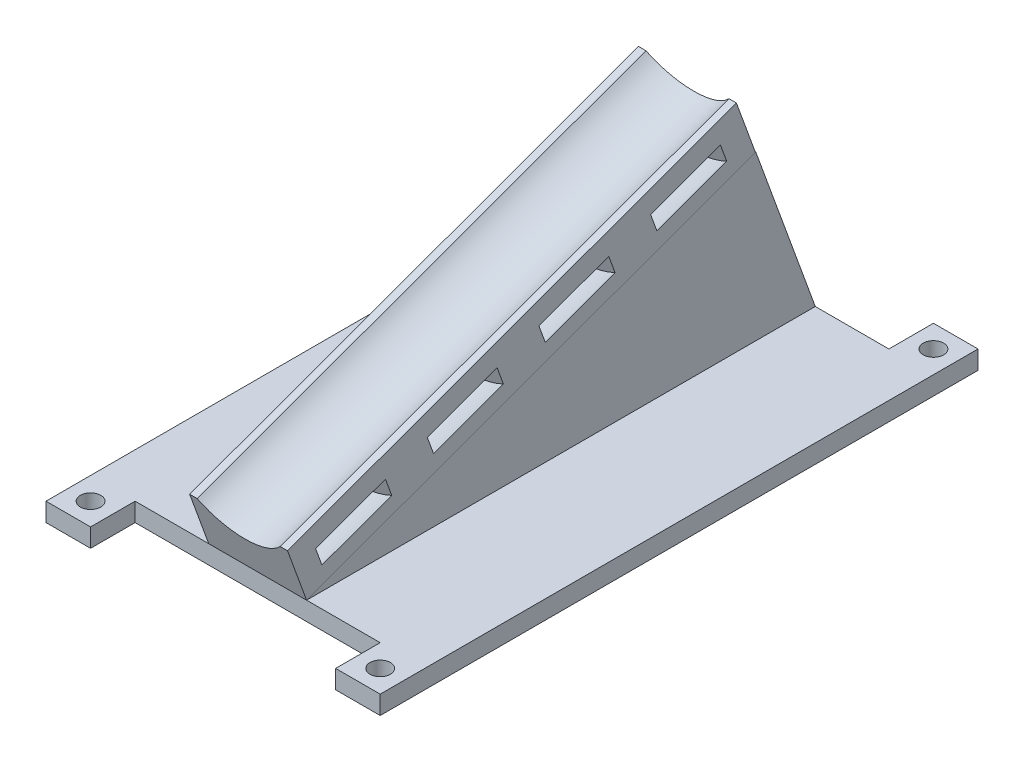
ISO-10303-21;
HEADER;
FILE_DESCRIPTION(('STEP AP214'),'2;1');
FILE_NAME('part.step','',(''),(''),'','','');
FILE_SCHEMA(('AUTOMOTIVE_DESIGN { 1 0 10303 214 1 1 1 1 }'));
ENDSEC;
DATA;
#1=APPLICATION_CONTEXT('core data for automotive mechanical design processes');
#2=APPLICATION_PROTOCOL_DEFINITION('international standard','automotive_design',2000,#1);
#3=PRODUCT_CONTEXT('',#1,'mechanical');
#4=PRODUCT('Part','Part','',(#3));
#5=PRODUCT_RELATED_PRODUCT_CATEGORY('part','',(#4));
#6=PRODUCT_DEFINITION_FORMATION('','',#4);
#7=PRODUCT_DEFINITION_CONTEXT('part definition',#1,'design');
#8=PRODUCT_DEFINITION('design','',#6,#7);
#9=PRODUCT_DEFINITION_SHAPE('','',#8);
#10=(LENGTH_UNIT() NAMED_UNIT(*) SI_UNIT(.MILLI.,.METRE.));
#11=(NAMED_UNIT(*) PLANE_ANGLE_UNIT() SI_UNIT($,.RADIAN.));
#12=(NAMED_UNIT(*) SI_UNIT($,.STERADIAN.) SOLID_ANGLE_UNIT());
#13=UNCERTAINTY_MEASURE_WITH_UNIT(LENGTH_MEASURE(1.E-05),#10,'distance_accuracy_value','');
#14=(GEOMETRIC_REPRESENTATION_CONTEXT(3) GLOBAL_UNCERTAINTY_ASSIGNED_CONTEXT((#13)) GLOBAL_UNIT_ASSIGNED_CONTEXT((#10,
#11,#12)) REPRESENTATION_CONTEXT('',''));
#15=CARTESIAN_POINT('',(0.,0.,0.));
#16=DIRECTION('',(0.,0.,1.));
#17=DIRECTION('',(1.,0.,0.));
#18=AXIS2_PLACEMENT_3D('',#15,#16,#17);
#19=CARTESIAN_POINT('',(58.1803398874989,48.9974712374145,-132.882058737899));
#20=DIRECTION('',(1.,0.,0.));
#21=DIRECTION('',(0.,0.,-1.));
#22=AXIS2_PLACEMENT_3D('',#19,#20,#21);
#23=PLANE('',#22);
#24=DIRECTION('',(0.,0.939692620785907,0.342020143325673));
#25=VECTOR('',#24,1.);
#26=CARTESIAN_POINT('',(58.1803398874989,5.,-12.));
#27=LINE('',#26,#25);
#28=CARTESIAN_POINT('',(58.1803398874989,5.,-12.));
#29=VERTEX_POINT('',#28);
#30=CARTESIAN_POINT('',(58.1803398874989,19.0953893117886,-6.86969785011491));
#31=VERTEX_POINT('',#30);
#32=EDGE_CURVE('E290',#29,#31,#27,.T.);
#33=ORIENTED_EDGE('',*,*,#32,.F.);
#34=DIRECTION('',(0.,-0.342020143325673,0.939692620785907));
#35=VECTOR('',#34,1.);
#36=CARTESIAN_POINT('',(58.1803398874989,48.9974712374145,-132.882058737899));
#37=LINE('',#36,#35);
#38=CARTESIAN_POINT('',(58.1803398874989,48.9974712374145,-132.882058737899));
#39=VERTEX_POINT('',#38);
#40=EDGE_CURVE('E327',#39,#29,#37,.T.);
#41=ORIENTED_EDGE('',*,*,#40,.F.);
#42=DIRECTION('',(0.,0.939692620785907,0.342020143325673));
#43=VECTOR('',#42,1.);
#44=CARTESIAN_POINT('',(58.1803398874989,48.9974712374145,-132.882058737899));
#45=LINE('',#44,#43);
#46=CARTESIAN_POINT('',(58.1803398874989,63.0928605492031,-127.751756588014));
#47=VERTEX_POINT('',#46);
#48=EDGE_CURVE('E291',#39,#47,#45,.T.);
#49=ORIENTED_EDGE('',*,*,#48,.T.);
#50=DIRECTION('',(0.,-0.342020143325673,0.939692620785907));
#51=VECTOR('',#50,1.);
#52=CARTESIAN_POINT('',(58.1803398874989,63.0928605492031,-127.751756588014));
#53=LINE('',#52,#51);
#54=EDGE_CURVE('E310',#47,#31,#53,.T.);
#55=ORIENTED_EDGE('',*,*,#54,.T.);
#56=EDGE_LOOP('',(#33,#41,#49,#55));
#57=FACE_BOUND('',#56,.T.);
#58=DIRECTION('',(0.,0.342020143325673,-0.939692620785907));
#59=VECTOR('',#58,1.);
#60=CARTESIAN_POINT('',(58.1803398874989,47.9359928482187,-117.254635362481));
#61=LINE('',#60,#59);
#62=CARTESIAN_POINT('',(58.1803398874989,17.9706339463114,-34.925488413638));
#63=VERTEX_POINT('',#62);
#64=CARTESIAN_POINT('',(58.1803398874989,11.130231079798,-16.1316359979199));
#65=VERTEX_POINT('',#64);
#66=EDGE_CURVE('E284',#63,#65,#61,.F.);
#67=ORIENTED_EDGE('',*,*,#66,.T.);
#68=DIRECTION('',(0.,0.939692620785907,0.342020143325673));
#69=VECTOR('',#68,1.);
#70=CARTESIAN_POINT('',(58.1803398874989,7.04498302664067,-17.6185446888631));
#71=LINE('',#70,#69);
#72=CARTESIAN_POINT('',(58.1803398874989,15.7829680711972,-14.4381782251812));
#73=VERTEX_POINT('',#72);
#74=EDGE_CURVE('E287',#65,#73,#71,.T.);
#75=ORIENTED_EDGE('',*,*,#74,.T.);
#76=DIRECTION('',(0.,0.342020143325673,-0.939692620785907));
#77=VECTOR('',#76,1.);
#78=CARTESIAN_POINT('',(58.1803398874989,52.5887298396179,-115.561177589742));
#79=LINE('',#78,#77);
#80=CARTESIAN_POINT('',(58.1803398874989,22.6233709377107,-33.2320306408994));
#81=VERTEX_POINT('',#80);
#82=EDGE_CURVE('E278',#73,#81,#79,.T.);
#83=ORIENTED_EDGE('',*,*,#82,.T.);
#84=DIRECTION('',(0.,-0.939692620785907,-0.342020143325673));
#85=VECTOR('',#84,1.);
#86=CARTESIAN_POINT('',(58.1803398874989,13.8853858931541,-36.4123971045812));
#87=LINE('',#86,#85);
#88=EDGE_CURVE('E281',#81,#63,#87,.T.);
#89=ORIENTED_EDGE('',*,*,#88,.T.);
#90=EDGE_LOOP('',(#67,#75,#83,#89));
#91=FACE_BOUND('',#90,.T.);
#92=DIRECTION('',(0.,0.342020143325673,-0.939692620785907));
#93=VECTOR('',#92,1.);
#94=CARTESIAN_POINT('',(58.1803398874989,58.8806374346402,-147.32479922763));
#95=LINE('',#94,#93);
#96=CARTESIAN_POINT('',(58.1803398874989,28.9152785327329,-64.995652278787));
#97=VERTEX_POINT('',#96);
#98=CARTESIAN_POINT('',(58.1803398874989,22.0748756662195,-46.2017998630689));
#99=VERTEX_POINT('',#98);
#100=EDGE_CURVE('E261',#97,#99,#95,.F.);
#101=ORIENTED_EDGE('',*,*,#100,.T.);
#102=DIRECTION('',(0.,0.939692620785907,0.342020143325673));
#103=VECTOR('',#102,1.);
#104=CARTESIAN_POINT('',(58.1803398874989,17.9896276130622,-47.6887085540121));
#105=LINE('',#104,#103);
#106=CARTESIAN_POINT('',(58.1803398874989,26.7276126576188,-44.5083420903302));
#107=VERTEX_POINT('',#106);
#108=EDGE_CURVE('E264',#99,#107,#105,.T.);
#109=ORIENTED_EDGE('',*,*,#108,.T.);
#110=DIRECTION('',(0.,0.342020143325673,-0.939692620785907));
#111=VECTOR('',#110,1.);
#112=CARTESIAN_POINT('',(58.1803398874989,63.5333744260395,-145.631341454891));
#113=LINE('',#112,#111);
#114=CARTESIAN_POINT('',(58.1803398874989,33.5680155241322,-63.3021945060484));
#115=VERTEX_POINT('',#114);
#116=EDGE_CURVE('E255',#107,#115,#113,.T.);
#117=ORIENTED_EDGE('',*,*,#116,.T.);
#118=DIRECTION('',(0.,-0.939692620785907,-0.342020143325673));
#119=VECTOR('',#118,1.);
#120=CARTESIAN_POINT('',(58.1803398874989,24.8300304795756,-66.4825609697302));
#121=LINE('',#120,#119);
#122=EDGE_CURVE('E258',#115,#97,#121,.T.);
#123=ORIENTED_EDGE('',*,*,#122,.T.);
#124=EDGE_LOOP('',(#101,#109,#117,#123));
#125=FACE_BOUND('',#124,.T.);
#126=DIRECTION('',(0.,0.342020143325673,-0.939692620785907));
#127=VECTOR('',#126,1.);
#128=CARTESIAN_POINT('',(58.1803398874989,69.8252820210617,-177.394963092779));
#129=LINE('',#128,#127);
#130=CARTESIAN_POINT('',(58.1803398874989,39.8599231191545,-95.0658161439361));
#131=VERTEX_POINT('',#130);
#132=CARTESIAN_POINT('',(58.1803398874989,33.019520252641,-76.2719637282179));
#133=VERTEX_POINT('',#132);
#134=EDGE_CURVE('E238',#131,#133,#129,.F.);
#135=ORIENTED_EDGE('',*,*,#134,.T.);
#136=DIRECTION('',(0.,0.939692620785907,0.342020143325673));
#137=VECTOR('',#136,1.);
#138=CARTESIAN_POINT('',(58.1803398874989,28.9342721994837,-77.7588724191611));
#139=LINE('',#138,#137);
#140=CARTESIAN_POINT('',(58.1803398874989,37.6722572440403,-74.5785059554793));
#141=VERTEX_POINT('',#140);
#142=EDGE_CURVE('E241',#133,#141,#139,.T.);
#143=ORIENTED_EDGE('',*,*,#142,.T.);
#144=DIRECTION('',(0.,0.342020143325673,-0.939692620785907));
#145=VECTOR('',#144,1.);
#146=CARTESIAN_POINT('',(58.1803398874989,74.478019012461,-175.70150532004));
#147=LINE('',#146,#145);
#148=CARTESIAN_POINT('',(58.1803398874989,44.5126601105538,-93.3723583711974));
#149=VERTEX_POINT('',#148);
#150=EDGE_CURVE('E232',#141,#149,#147,.T.);
#151=ORIENTED_EDGE('',*,*,#150,.T.);
#152=DIRECTION('',(0.,-0.939692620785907,-0.342020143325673));
#153=VECTOR('',#152,1.);
#154=CARTESIAN_POINT('',(58.1803398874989,35.7746750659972,-96.5527248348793));
#155=LINE('',#154,#153);
#156=EDGE_CURVE('E235',#149,#131,#155,.T.);
#157=ORIENTED_EDGE('',*,*,#156,.T.);
#158=EDGE_LOOP('',(#135,#143,#151,#157));
#159=FACE_BOUND('',#158,.T.);
#160=DIRECTION('',(0.,0.342020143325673,-0.939692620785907));
#161=VECTOR('',#160,1.);
#162=CARTESIAN_POINT('',(58.1803398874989,80.7699266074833,-207.465126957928));
#163=LINE('',#162,#161);
#164=CARTESIAN_POINT('',(58.1803398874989,50.804567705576,-125.135980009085));
#165=VERTEX_POINT('',#164);
#166=CARTESIAN_POINT('',(58.1803398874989,43.9641648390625,-106.342127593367));
#167=VERTEX_POINT('',#166);
#168=EDGE_CURVE('E216',#165,#167,#163,.F.);
#169=ORIENTED_EDGE('',*,*,#168,.T.);
#170=DIRECTION('',(0.,0.939692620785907,0.342020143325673));
#171=VECTOR('',#170,1.);
#172=CARTESIAN_POINT('',(58.1803398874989,39.8789167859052,-107.82903628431));
#173=LINE('',#172,#171);
#174=CARTESIAN_POINT('',(58.1803398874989,48.6169018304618,-104.648669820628));
#175=VERTEX_POINT('',#174);
#176=EDGE_CURVE('E211',#167,#175,#173,.T.);
#177=ORIENTED_EDGE('',*,*,#176,.T.);
#178=DIRECTION('',(0.,0.342020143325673,-0.939692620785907));
#179=VECTOR('',#178,1.);
#180=CARTESIAN_POINT('',(58.1803398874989,85.4226635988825,-205.771669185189));
#181=LINE('',#180,#179);
#182=CARTESIAN_POINT('',(58.1803398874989,55.4573046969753,-123.442522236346));
#183=VERTEX_POINT('',#182);
#184=EDGE_CURVE('E200',#175,#183,#181,.T.);
#185=ORIENTED_EDGE('',*,*,#184,.T.);
#186=DIRECTION('',(0.,-0.939692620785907,-0.342020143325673));
#187=VECTOR('',#186,1.);
#188=CARTESIAN_POINT('',(58.1803398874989,46.7193196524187,-126.622888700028));
#189=LINE('',#188,#187);
#190=EDGE_CURVE('E205',#183,#165,#189,.T.);
#191=ORIENTED_EDGE('',*,*,#190,.T.);
#192=EDGE_LOOP('',(#169,#177,#185,#191));
#193=FACE_BOUND('',#192,.T.);
#194=ADVANCED_FACE('F55',(#57,#91,#125,#159,#193),#23,.T.);
#195=CARTESIAN_POINT('',(31.8196601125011,63.0928605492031,-127.751756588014));
#196=DIRECTION('',(-1.,0.,0.));
#197=DIRECTION('',(0.,-1.,0.));
#198=AXIS2_PLACEMENT_3D('',#195,#196,#197);
#199=PLANE('',#198);
#200=DIRECTION('',(0.,-0.939692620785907,-0.342020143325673));
#201=VECTOR('',#200,1.);
#202=CARTESIAN_POINT('',(31.8196601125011,19.0953893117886,-6.86969785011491));
#203=LINE('',#202,#201);
#204=CARTESIAN_POINT('',(31.8196601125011,19.0953893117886,-6.86969785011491));
#205=VERTEX_POINT('',#204);
#206=CARTESIAN_POINT('',(31.8196601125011,5.,-12.));
#207=VERTEX_POINT('',#206);
#208=EDGE_CURVE('E322',#205,#207,#203,.T.);
#209=ORIENTED_EDGE('',*,*,#208,.F.);
#210=DIRECTION('',(0.,-0.342020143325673,0.939692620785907));
#211=VECTOR('',#210,1.);
#212=CARTESIAN_POINT('',(31.8196601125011,63.0928605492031,-127.751756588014));
#213=LINE('',#212,#211);
#214=CARTESIAN_POINT('',(31.8196601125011,63.0928605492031,-127.751756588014));
#215=VERTEX_POINT('',#214);
#216=EDGE_CURVE('E332',#215,#205,#213,.T.);
#217=ORIENTED_EDGE('',*,*,#216,.F.);
#218=DIRECTION('',(0.,-0.939692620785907,-0.342020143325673));
#219=VECTOR('',#218,1.);
#220=CARTESIAN_POINT('',(31.8196601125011,63.0928605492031,-127.751756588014));
#221=LINE('',#220,#219);
#222=CARTESIAN_POINT('',(31.8196601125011,48.9974712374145,-132.882058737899));
#223=VERTEX_POINT('',#222);
#224=EDGE_CURVE('E304',#215,#223,#221,.T.);
#225=ORIENTED_EDGE('',*,*,#224,.T.);
#226=DIRECTION('',(0.,-0.342020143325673,0.939692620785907));
#227=VECTOR('',#226,1.);
#228=CARTESIAN_POINT('',(31.8196601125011,48.9974712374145,-132.882058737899));
#229=LINE('',#228,#227);
#230=EDGE_CURVE('E330',#223,#207,#229,.T.);
#231=ORIENTED_EDGE('',*,*,#230,.T.);
#232=EDGE_LOOP('',(#209,#217,#225,#231));
#233=FACE_BOUND('',#232,.T.);
#234=DIRECTION('',(0.,0.342020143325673,-0.939692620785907));
#235=VECTOR('',#234,1.);
#236=CARTESIAN_POINT('',(31.8196601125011,52.5887298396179,-115.561177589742));
#237=LINE('',#236,#235);
#238=CARTESIAN_POINT('',(31.8196601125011,22.6233709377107,-33.2320306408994));
#239=VERTEX_POINT('',#238);
#240=CARTESIAN_POINT('',(31.8196601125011,15.7829680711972,-14.4381782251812));
#241=VERTEX_POINT('',#240);
#242=EDGE_CURVE('E329',#239,#241,#237,.F.);
#243=ORIENTED_EDGE('',*,*,#242,.T.);
#244=DIRECTION('',(0.,-0.939692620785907,-0.342020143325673));
#245=VECTOR('',#244,1.);
#246=CARTESIAN_POINT('',(31.8196601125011,21.1403723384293,-12.488242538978));
#247=LINE('',#246,#245);
#248=CARTESIAN_POINT('',(31.8196601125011,11.130231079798,-16.1316359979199));
#249=VERTEX_POINT('',#248);
#250=EDGE_CURVE('E347',#241,#249,#247,.T.);
#251=ORIENTED_EDGE('',*,*,#250,.T.);
#252=DIRECTION('',(0.,0.342020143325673,-0.939692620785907));
#253=VECTOR('',#252,1.);
#254=CARTESIAN_POINT('',(31.8196601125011,47.9359928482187,-117.254635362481));
#255=LINE('',#254,#253);
#256=CARTESIAN_POINT('',(31.8196601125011,17.9706339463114,-34.925488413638));
#257=VERTEX_POINT('',#256);
#258=EDGE_CURVE('E344',#249,#257,#255,.T.);
#259=ORIENTED_EDGE('',*,*,#258,.T.);
#260=DIRECTION('',(0.,0.939692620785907,0.342020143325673));
#261=VECTOR('',#260,1.);
#262=CARTESIAN_POINT('',(31.8196601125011,27.9807752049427,-31.2820949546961));
#263=LINE('',#262,#261);
#264=EDGE_CURVE('E341',#257,#239,#263,.T.);
#265=ORIENTED_EDGE('',*,*,#264,.T.);
#266=EDGE_LOOP('',(#243,#251,#259,#265));
#267=FACE_BOUND('',#266,.T.);
#268=DIRECTION('',(0.,0.342020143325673,-0.939692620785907));
#269=VECTOR('',#268,1.);
#270=CARTESIAN_POINT('',(31.8196601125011,63.5333744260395,-145.631341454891));
#271=LINE('',#270,#269);
#272=CARTESIAN_POINT('',(31.8196601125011,33.5680155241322,-63.3021945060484));
#273=VERTEX_POINT('',#272);
#274=CARTESIAN_POINT('',(31.8196601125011,26.7276126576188,-44.5083420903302));
#275=VERTEX_POINT('',#274);
#276=EDGE_CURVE('E350',#273,#275,#271,.F.);
#277=ORIENTED_EDGE('',*,*,#276,.T.);
#278=DIRECTION('',(0.,-0.939692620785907,-0.342020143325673));
#279=VECTOR('',#278,1.);
#280=CARTESIAN_POINT('',(31.8196601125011,32.0850169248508,-42.558406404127));
#281=LINE('',#280,#279);
#282=CARTESIAN_POINT('',(31.8196601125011,22.0748756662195,-46.2017998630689));
#283=VERTEX_POINT('',#282);
#284=EDGE_CURVE('E359',#275,#283,#281,.T.);
#285=ORIENTED_EDGE('',*,*,#284,.T.);
#286=DIRECTION('',(0.,0.342020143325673,-0.939692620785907));
#287=VECTOR('',#286,1.);
#288=CARTESIAN_POINT('',(31.8196601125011,58.8806374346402,-147.32479922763));
#289=LINE('',#288,#287);
#290=CARTESIAN_POINT('',(31.8196601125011,28.9152785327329,-64.995652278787));
#291=VERTEX_POINT('',#290);
#292=EDGE_CURVE('E356',#283,#291,#289,.T.);
#293=ORIENTED_EDGE('',*,*,#292,.T.);
#294=DIRECTION('',(0.,0.939692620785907,0.342020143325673));
#295=VECTOR('',#294,1.);
#296=CARTESIAN_POINT('',(31.8196601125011,38.9254197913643,-61.3522588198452));
#297=LINE('',#296,#295);
#298=EDGE_CURVE('E353',#291,#273,#297,.T.);
#299=ORIENTED_EDGE('',*,*,#298,.T.);
#300=EDGE_LOOP('',(#277,#285,#293,#299));
#301=FACE_BOUND('',#300,.T.);
#302=DIRECTION('',(0.,0.342020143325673,-0.939692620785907));
#303=VECTOR('',#302,1.);
#304=CARTESIAN_POINT('',(31.8196601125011,74.478019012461,-175.70150532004));
#305=LINE('',#304,#303);
#306=CARTESIAN_POINT('',(31.8196601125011,44.5126601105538,-93.3723583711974));
#307=VERTEX_POINT('',#306);
#308=CARTESIAN_POINT('',(31.8196601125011,37.6722572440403,-74.5785059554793));
#309=VERTEX_POINT('',#308);
#310=EDGE_CURVE('E362',#307,#309,#305,.F.);
#311=ORIENTED_EDGE('',*,*,#310,.T.);
#312=DIRECTION('',(0.,-0.939692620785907,-0.342020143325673));
#313=VECTOR('',#312,1.);
#314=CARTESIAN_POINT('',(31.8196601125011,43.0296615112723,-72.6285702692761));
#315=LINE('',#314,#313);
#316=CARTESIAN_POINT('',(31.8196601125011,33.019520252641,-76.2719637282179));
#317=VERTEX_POINT('',#316);
#318=EDGE_CURVE('E371',#309,#317,#315,.T.);
#319=ORIENTED_EDGE('',*,*,#318,.T.);
#320=DIRECTION('',(0.,0.342020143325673,-0.939692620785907));
#321=VECTOR('',#320,1.);
#322=CARTESIAN_POINT('',(31.8196601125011,69.8252820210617,-177.394963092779));
#323=LINE('',#322,#321);
#324=CARTESIAN_POINT('',(31.8196601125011,39.8599231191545,-95.0658161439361));
#325=VERTEX_POINT('',#324);
#326=EDGE_CURVE('E368',#317,#325,#323,.T.);
#327=ORIENTED_EDGE('',*,*,#326,.T.);
#328=DIRECTION('',(0.,0.939692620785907,0.342020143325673));
#329=VECTOR('',#328,1.);
#330=CARTESIAN_POINT('',(31.8196601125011,49.8700643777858,-91.4224226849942));
#331=LINE('',#330,#329);
#332=EDGE_CURVE('E365',#325,#307,#331,.T.);
#333=ORIENTED_EDGE('',*,*,#332,.T.);
#334=EDGE_LOOP('',(#311,#319,#327,#333));
#335=FACE_BOUND('',#334,.T.);
#336=DIRECTION('',(0.,0.342020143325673,-0.939692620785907));
#337=VECTOR('',#336,1.);
#338=CARTESIAN_POINT('',(31.8196601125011,85.4226635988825,-205.771669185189));
#339=LINE('',#338,#337);
#340=CARTESIAN_POINT('',(31.8196601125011,55.4573046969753,-123.442522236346));
#341=VERTEX_POINT('',#340);
#342=CARTESIAN_POINT('',(31.8196601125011,48.6169018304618,-104.648669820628));
#343=VERTEX_POINT('',#342);
#344=EDGE_CURVE('E374',#341,#343,#339,.F.);
#345=ORIENTED_EDGE('',*,*,#344,.T.);
#346=DIRECTION('',(0.,-0.939692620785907,-0.342020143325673));
#347=VECTOR('',#346,1.);
#348=CARTESIAN_POINT('',(31.8196601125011,53.9743060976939,-102.698734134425));
#349=LINE('',#348,#347);
#350=CARTESIAN_POINT('',(31.8196601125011,43.9641648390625,-106.342127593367));
#351=VERTEX_POINT('',#350);
#352=EDGE_CURVE('E12',#343,#351,#349,.T.);
#353=ORIENTED_EDGE('',*,*,#352,.T.);
#354=DIRECTION('',(0.,0.342020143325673,-0.939692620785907));
#355=VECTOR('',#354,1.);
#356=CARTESIAN_POINT('',(31.8196601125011,80.7699266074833,-207.465126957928));
#357=LINE('',#356,#355);
#358=CARTESIAN_POINT('',(31.8196601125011,50.804567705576,-125.135980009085));
#359=VERTEX_POINT('',#358);
#360=EDGE_CURVE('E62',#351,#359,#357,.T.);
#361=ORIENTED_EDGE('',*,*,#360,.T.);
#362=DIRECTION('',(0.,0.939692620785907,0.342020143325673));
#363=VECTOR('',#362,1.);
#364=CARTESIAN_POINT('',(31.8196601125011,60.8147089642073,-121.492586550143));
#365=LINE('',#364,#363);
#366=EDGE_CURVE('E376',#359,#341,#365,.T.);
#367=ORIENTED_EDGE('',*,*,#366,.T.);
#368=EDGE_LOOP('',(#345,#353,#361,#367));
#369=FACE_BOUND('',#368,.T.);
#370=ADVANCED_FACE('F380',(#233,#267,#301,#335,#369),#199,.T.);
#371=CARTESIAN_POINT('',(31.8196601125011,48.9974712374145,-132.882058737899));
#372=DIRECTION('',(0.,-0.939692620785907,-0.342020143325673));
#373=DIRECTION('',(0.,0.342020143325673,-0.939692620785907));
#374=AXIS2_PLACEMENT_3D('',#371,#372,#373);
#375=PLANE('',#374);
#376=DIRECTION('',(1.,0.,0.));
#377=VECTOR('',#376,1.);
#378=CARTESIAN_POINT('',(31.8196601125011,5.,-12.));
#379=LINE('',#378,#377);
#380=EDGE_CURVE('E295',#207,#29,#379,.T.);
#381=ORIENTED_EDGE('',*,*,#380,.F.);
#382=ORIENTED_EDGE('',*,*,#230,.F.);
#383=DIRECTION('',(1.,0.,0.));
#384=VECTOR('',#383,1.);
#385=CARTESIAN_POINT('',(31.8196601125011,48.9974712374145,-132.882058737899));
#386=LINE('',#385,#384);
#387=EDGE_CURVE('E307',#223,#39,#386,.T.);
#388=ORIENTED_EDGE('',*,*,#387,.T.);
#389=ORIENTED_EDGE('',*,*,#40,.T.);
#390=EDGE_LOOP('',(#381,#382,#388,#389));
#391=FACE_BOUND('',#390,.T.);
#392=ADVANCED_FACE('F405',(#391),#375,.T.);
#393=CARTESIAN_POINT('',(33.8196601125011,63.0928605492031,-127.751756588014));
#394=DIRECTION('',(0.,0.939692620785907,0.342020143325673));
#395=DIRECTION('',(0.,-0.342020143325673,0.939692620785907));
#396=AXIS2_PLACEMENT_3D('',#393,#394,#395);
#397=PLANE('',#396);
#398=DIRECTION('',(-1.,0.,0.));
#399=VECTOR('',#398,1.);
#400=CARTESIAN_POINT('',(33.8196601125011,19.0953893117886,-6.86969785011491));
#401=LINE('',#400,#399);
#402=CARTESIAN_POINT('',(33.8196601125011,19.0953893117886,-6.86969785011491));
#403=VERTEX_POINT('',#402);
#404=EDGE_CURVE('E319',#403,#205,#401,.T.);
#405=ORIENTED_EDGE('',*,*,#404,.F.);
#406=DIRECTION('',(0.,-0.342020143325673,0.939692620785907));
#407=VECTOR('',#406,1.);
#408=CARTESIAN_POINT('',(33.8196601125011,63.0928605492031,-127.751756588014));
#409=LINE('',#408,#407);
#410=CARTESIAN_POINT('',(33.8196601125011,63.0928605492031,-127.751756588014));
#411=VERTEX_POINT('',#410);
#412=EDGE_CURVE('E334',#411,#403,#409,.T.);
#413=ORIENTED_EDGE('',*,*,#412,.F.);
#414=DIRECTION('',(-1.,0.,0.));
#415=VECTOR('',#414,1.);
#416=CARTESIAN_POINT('',(33.8196601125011,63.0928605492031,-127.751756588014));
#417=LINE('',#416,#415);
#418=EDGE_CURVE('E301',#411,#215,#417,.T.);
#419=ORIENTED_EDGE('',*,*,#418,.T.);
#420=ORIENTED_EDGE('',*,*,#216,.T.);
#421=EDGE_LOOP('',(#405,#413,#419,#420));
#422=FACE_BOUND('',#421,.T.);
#423=ADVANCED_FACE('F480',(#422),#397,.T.);
#424=CARTESIAN_POINT('',(45.,72.4897867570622,-124.331555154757));
#425=DIRECTION('',(0.,-0.342020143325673,0.939692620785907));
#426=DIRECTION('',(0.,-0.939692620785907,-0.342020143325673));
#427=AXIS2_PLACEMENT_3D('',#424,#425,#426);
#428=CYLINDRICAL_SURFACE('',#427,15.);
#429=CARTESIAN_POINT('',(45.,28.4923155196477,-3.44949641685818));
#430=DIRECTION('',(0.,0.342020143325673,-0.939692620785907));
#431=DIRECTION('',(0.,-0.939692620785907,-0.342020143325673));
#432=AXIS2_PLACEMENT_3D('',#429,#430,#431);
#433=CIRCLE('',#432,15.);
#434=CARTESIAN_POINT('',(56.1803398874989,19.0953893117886,-6.86969785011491));
#435=VERTEX_POINT('',#434);
#436=EDGE_CURVE('E316',#435,#403,#433,.T.);
#437=ORIENTED_EDGE('',*,*,#436,.F.);
#438=DIRECTION('',(0.,-0.342020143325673,0.939692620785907));
#439=VECTOR('',#438,1.);
#440=CARTESIAN_POINT('',(56.1803398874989,63.0928605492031,-127.751756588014));
#441=LINE('',#440,#439);
#442=CARTESIAN_POINT('',(56.1803398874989,63.0928605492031,-127.751756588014));
#443=VERTEX_POINT('',#442);
#444=EDGE_CURVE('E336',#443,#435,#441,.T.);
#445=ORIENTED_EDGE('',*,*,#444,.F.);
#446=CARTESIAN_POINT('',(45.,72.4897867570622,-124.331555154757));
#447=DIRECTION('',(0.,0.342020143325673,-0.939692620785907));
#448=DIRECTION('',(0.,-0.939692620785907,-0.342020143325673));
#449=AXIS2_PLACEMENT_3D('',#446,#447,#448);
#450=CIRCLE('',#449,15.);
#451=EDGE_CURVE('E298',#443,#411,#450,.T.);
#452=ORIENTED_EDGE('',*,*,#451,.T.);
#453=ORIENTED_EDGE('',*,*,#412,.T.);
#454=EDGE_LOOP('',(#437,#445,#452,#453));
#455=FACE_BOUND('',#454,.T.);
#456=ADVANCED_FACE('F485',(#455),#428,.F.);
#457=CARTESIAN_POINT('',(58.1803398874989,63.0928605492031,-127.751756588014));
#458=DIRECTION('',(0.,0.939692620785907,0.342020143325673));
#459=DIRECTION('',(0.,-0.342020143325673,0.939692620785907));
#460=AXIS2_PLACEMENT_3D('',#457,#458,#459);
#461=PLANE('',#460);
#462=DIRECTION('',(-1.,0.,0.));
#463=VECTOR('',#462,1.);
#464=CARTESIAN_POINT('',(58.1803398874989,19.0953893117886,-6.86969785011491));
#465=LINE('',#464,#463);
#466=EDGE_CURVE('E313',#31,#435,#465,.T.);
#467=ORIENTED_EDGE('',*,*,#466,.F.);
#468=ORIENTED_EDGE('',*,*,#54,.F.);
#469=DIRECTION('',(-1.,0.,0.));
#470=VECTOR('',#469,1.);
#471=CARTESIAN_POINT('',(58.1803398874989,63.0928605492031,-127.751756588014));
#472=LINE('',#471,#470);
#473=EDGE_CURVE('E294',#47,#443,#472,.T.);
#474=ORIENTED_EDGE('',*,*,#473,.T.);
#475=ORIENTED_EDGE('',*,*,#444,.T.);
#476=EDGE_LOOP('',(#467,#468,#474,#475));
#477=FACE_BOUND('',#476,.T.);
#478=ADVANCED_FACE('F474',(#477),#461,.T.);
#479=CARTESIAN_POINT('',(45.,72.4897867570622,-124.331555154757));
#480=DIRECTION('',(0.,-0.342020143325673,0.939692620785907));
#481=DIRECTION('',(0.,-0.939692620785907,-0.342020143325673));
#482=AXIS2_PLACEMENT_3D('',#479,#480,#481);
#483=PLANE('',#482);
#484=ORIENTED_EDGE('',*,*,#48,.F.);
#485=ORIENTED_EDGE('',*,*,#387,.F.);
#486=ORIENTED_EDGE('',*,*,#224,.F.);
#487=ORIENTED_EDGE('',*,*,#418,.F.);
#488=ORIENTED_EDGE('',*,*,#451,.F.);
#489=ORIENTED_EDGE('',*,*,#473,.F.);
#490=EDGE_LOOP('',(#484,#485,#486,#487,#488,#489));
#491=FACE_BOUND('',#490,.T.);
#492=ADVANCED_FACE('F471',(#491),#483,.F.);
#493=CARTESIAN_POINT('',(45.,28.4923155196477,-3.44949641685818));
#494=DIRECTION('',(0.,-0.342020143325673,0.939692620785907));
#495=DIRECTION('',(0.,-0.939692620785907,-0.342020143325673));
#496=AXIS2_PLACEMENT_3D('',#493,#494,#495);
#497=PLANE('',#496);
#498=ORIENTED_EDGE('',*,*,#32,.T.);
#499=ORIENTED_EDGE('',*,*,#466,.T.);
#500=ORIENTED_EDGE('',*,*,#436,.T.);
#501=ORIENTED_EDGE('',*,*,#404,.T.);
#502=ORIENTED_EDGE('',*,*,#208,.T.);
#503=ORIENTED_EDGE('',*,*,#380,.T.);
#504=EDGE_LOOP('',(#498,#499,#500,#501,#502,#503));
#505=FACE_BOUND('',#504,.T.);
#506=ADVANCED_FACE('F469',(#505),#497,.T.);
#507=CARTESIAN_POINT('',(45.,11.2735998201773,-16.0794540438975));
#508=DIRECTION('',(0.,0.342020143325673,-0.939692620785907));
#509=DIRECTION('',(0.,0.939692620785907,0.342020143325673));
#510=AXIS2_PLACEMENT_3D('',#507,#508,#509);
#511=PLANE('',#510);
#512=CARTESIAN_POINT('',(45.,30.5372985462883,-9.06804110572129));
#513=DIRECTION('',(0.,0.342020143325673,-0.939692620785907));
#514=DIRECTION('',(0.,0.939692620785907,0.342020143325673));
#515=AXIS2_PLACEMENT_3D('',#512,#513,#514);
#516=CIRCLE('',#515,24.5);
#517=EDGE_CURVE('E275',#65,#249,#516,.T.);
#518=ORIENTED_EDGE('',*,*,#517,.T.);
#519=ORIENTED_EDGE('',*,*,#250,.F.);
#520=CARTESIAN_POINT('',(45.,30.5372985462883,-9.06804110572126));
#521=DIRECTION('',(0.,0.342020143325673,-0.939692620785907));
#522=DIRECTION('',(0.,0.939692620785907,0.342020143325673));
#523=AXIS2_PLACEMENT_3D('',#520,#521,#522);
#524=CIRCLE('',#523,20.5);
#525=EDGE_CURVE('E267',#73,#241,#524,.T.);
#526=ORIENTED_EDGE('',*,*,#525,.F.);
#527=ORIENTED_EDGE('',*,*,#74,.F.);
#528=EDGE_LOOP('',(#518,#519,#526,#527));
#529=FACE_BOUND('',#528,.T.);
#530=ADVANCED_FACE('F465',(#529),#511,.T.);
#531=CARTESIAN_POINT('',(45.,67.343060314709,-110.191040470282));
#532=DIRECTION('',(0.,0.342020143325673,-0.939692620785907));
#533=DIRECTION('',(0.,0.939692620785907,0.342020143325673));
#534=AXIS2_PLACEMENT_3D('',#531,#532,#533);
#535=CYLINDRICAL_SURFACE('',#534,24.5);
#536=CARTESIAN_POINT('',(45.,37.3777014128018,-27.8618935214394));
#537=DIRECTION('',(0.,0.342020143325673,-0.939692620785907));
#538=DIRECTION('',(0.,0.939692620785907,0.342020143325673));
#539=AXIS2_PLACEMENT_3D('',#536,#537,#538);
#540=CIRCLE('',#539,24.5);
#541=EDGE_CURVE('E272',#63,#257,#540,.T.);
#542=ORIENTED_EDGE('',*,*,#541,.T.);
#543=ORIENTED_EDGE('',*,*,#258,.F.);
#544=ORIENTED_EDGE('',*,*,#517,.F.);
#545=ORIENTED_EDGE('',*,*,#66,.F.);
#546=EDGE_LOOP('',(#542,#543,#544,#545));
#547=FACE_BOUND('',#546,.T.);
#548=ADVANCED_FACE('F461',(#547),#535,.F.);
#549=CARTESIAN_POINT('',(45.,14.3552322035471,-36.2413870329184));
#550=DIRECTION('',(0.,-0.342020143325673,0.939692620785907));
#551=DIRECTION('',(0.,-0.939692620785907,-0.342020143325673));
#552=AXIS2_PLACEMENT_3D('',#549,#550,#551);
#553=PLANE('',#552);
#554=CARTESIAN_POINT('',(45.,37.3777014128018,-27.8618935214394));
#555=DIRECTION('',(0.,0.342020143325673,-0.939692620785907));
#556=DIRECTION('',(0.,0.939692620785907,0.342020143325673));
#557=AXIS2_PLACEMENT_3D('',#554,#555,#556);
#558=CIRCLE('',#557,20.5);
#559=EDGE_CURVE('E269',#81,#239,#558,.T.);
#560=ORIENTED_EDGE('',*,*,#559,.T.);
#561=ORIENTED_EDGE('',*,*,#264,.F.);
#562=ORIENTED_EDGE('',*,*,#541,.F.);
#563=ORIENTED_EDGE('',*,*,#88,.F.);
#564=EDGE_LOOP('',(#560,#561,#562,#563));
#565=FACE_BOUND('',#564,.T.);
#566=ADVANCED_FACE('F457',(#565),#553,.T.);
#567=CARTESIAN_POINT('',(45.,67.343060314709,-110.191040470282));
#568=DIRECTION('',(0.,0.342020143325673,-0.939692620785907));
#569=DIRECTION('',(0.,0.939692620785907,0.342020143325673));
#570=AXIS2_PLACEMENT_3D('',#567,#568,#569);
#571=CYLINDRICAL_SURFACE('',#570,20.5);
#572=ORIENTED_EDGE('',*,*,#525,.T.);
#573=ORIENTED_EDGE('',*,*,#242,.F.);
#574=ORIENTED_EDGE('',*,*,#559,.F.);
#575=ORIENTED_EDGE('',*,*,#82,.F.);
#576=EDGE_LOOP('',(#572,#573,#574,#575));
#577=FACE_BOUND('',#576,.T.);
#578=ADVANCED_FACE('F454',(#577),#571,.T.);
#579=CARTESIAN_POINT('',(45.,22.2182444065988,-46.1496179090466));
#580=DIRECTION('',(0.,0.342020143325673,-0.939692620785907));
#581=DIRECTION('',(0.,0.939692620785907,0.342020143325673));
#582=AXIS2_PLACEMENT_3D('',#579,#580,#581);
#583=PLANE('',#582);
#584=CARTESIAN_POINT('',(45.,41.4819431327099,-39.1382049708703));
#585=DIRECTION('',(0.,0.342020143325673,-0.939692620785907));
#586=DIRECTION('',(0.,0.939692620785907,0.342020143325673));
#587=AXIS2_PLACEMENT_3D('',#584,#585,#586);
#588=CIRCLE('',#587,24.5);
#589=EDGE_CURVE('E252',#99,#283,#588,.T.);
#590=ORIENTED_EDGE('',*,*,#589,.T.);
#591=ORIENTED_EDGE('',*,*,#284,.F.);
#592=CARTESIAN_POINT('',(45.,41.4819431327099,-39.1382049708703));
#593=DIRECTION('',(0.,0.342020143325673,-0.939692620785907));
#594=DIRECTION('',(0.,0.939692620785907,0.342020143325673));
#595=AXIS2_PLACEMENT_3D('',#592,#593,#594);
#596=CIRCLE('',#595,20.5);
#597=EDGE_CURVE('E244',#107,#275,#596,.T.);
#598=ORIENTED_EDGE('',*,*,#597,.F.);
#599=ORIENTED_EDGE('',*,*,#108,.F.);
#600=EDGE_LOOP('',(#590,#591,#598,#599));
#601=FACE_BOUND('',#600,.T.);
#602=ADVANCED_FACE('F450',(#601),#583,.T.);
#603=CARTESIAN_POINT('',(45.,78.2877049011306,-140.261204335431));
#604=DIRECTION('',(0.,0.342020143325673,-0.939692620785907));
#605=DIRECTION('',(0.,0.939692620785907,0.342020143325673));
#606=AXIS2_PLACEMENT_3D('',#603,#604,#605);
#607=CYLINDRICAL_SURFACE('',#606,24.5);
#608=CARTESIAN_POINT('',(45.,48.3223459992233,-57.9320573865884));
#609=DIRECTION('',(0.,0.342020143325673,-0.939692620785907));
#610=DIRECTION('',(0.,0.939692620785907,0.342020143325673));
#611=AXIS2_PLACEMENT_3D('',#608,#609,#610);
#612=CIRCLE('',#611,24.5);
#613=EDGE_CURVE('E249',#97,#291,#612,.T.);
#614=ORIENTED_EDGE('',*,*,#613,.T.);
#615=ORIENTED_EDGE('',*,*,#292,.F.);
#616=ORIENTED_EDGE('',*,*,#589,.F.);
#617=ORIENTED_EDGE('',*,*,#100,.F.);
#618=EDGE_LOOP('',(#614,#615,#616,#617));
#619=FACE_BOUND('',#618,.T.);
#620=ADVANCED_FACE('F446',(#619),#607,.F.);
#621=CARTESIAN_POINT('',(45.,25.2998767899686,-66.3115508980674));
#622=DIRECTION('',(0.,-0.342020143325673,0.939692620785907));
#623=DIRECTION('',(0.,-0.939692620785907,-0.342020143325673));
#624=AXIS2_PLACEMENT_3D('',#621,#622,#623);
#625=PLANE('',#624);
#626=CARTESIAN_POINT('',(45.,48.3223459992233,-57.9320573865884));
#627=DIRECTION('',(0.,0.342020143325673,-0.939692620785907));
#628=DIRECTION('',(0.,0.939692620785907,0.342020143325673));
#629=AXIS2_PLACEMENT_3D('',#626,#627,#628);
#630=CIRCLE('',#629,20.5);
#631=EDGE_CURVE('E246',#115,#273,#630,.T.);
#632=ORIENTED_EDGE('',*,*,#631,.T.);
#633=ORIENTED_EDGE('',*,*,#298,.F.);
#634=ORIENTED_EDGE('',*,*,#613,.F.);
#635=ORIENTED_EDGE('',*,*,#122,.F.);
#636=EDGE_LOOP('',(#632,#633,#634,#635));
#637=FACE_BOUND('',#636,.T.);
#638=ADVANCED_FACE('F442',(#637),#625,.T.);
#639=CARTESIAN_POINT('',(45.,78.2877049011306,-140.261204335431));
#640=DIRECTION('',(0.,0.342020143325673,-0.939692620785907));
#641=DIRECTION('',(0.,0.939692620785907,0.342020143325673));
#642=AXIS2_PLACEMENT_3D('',#639,#640,#641);
#643=CYLINDRICAL_SURFACE('',#642,20.5);
#644=ORIENTED_EDGE('',*,*,#597,.T.);
#645=ORIENTED_EDGE('',*,*,#276,.F.);
#646=ORIENTED_EDGE('',*,*,#631,.F.);
#647=ORIENTED_EDGE('',*,*,#116,.F.);
#648=EDGE_LOOP('',(#644,#645,#646,#647));
#649=FACE_BOUND('',#648,.T.);
#650=ADVANCED_FACE('F439',(#649),#643,.T.);
#651=CARTESIAN_POINT('',(45.,33.1628889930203,-76.2197817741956));
#652=DIRECTION('',(0.,0.342020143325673,-0.939692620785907));
#653=DIRECTION('',(0.,0.939692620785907,0.342020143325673));
#654=AXIS2_PLACEMENT_3D('',#651,#652,#653);
#655=PLANE('',#654);
#656=CARTESIAN_POINT('',(45.,52.4265877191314,-69.2083688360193));
#657=DIRECTION('',(0.,0.342020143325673,-0.939692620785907));
#658=DIRECTION('',(0.,0.939692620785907,0.342020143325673));
#659=AXIS2_PLACEMENT_3D('',#656,#657,#658);
#660=CIRCLE('',#659,24.5);
#661=EDGE_CURVE('E229',#133,#317,#660,.T.);
#662=ORIENTED_EDGE('',*,*,#661,.T.);
#663=ORIENTED_EDGE('',*,*,#318,.F.);
#664=CARTESIAN_POINT('',(45.,52.4265877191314,-69.2083688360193));
#665=DIRECTION('',(0.,0.342020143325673,-0.939692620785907));
#666=DIRECTION('',(0.,0.939692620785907,0.342020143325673));
#667=AXIS2_PLACEMENT_3D('',#664,#665,#666);
#668=CIRCLE('',#667,20.5);
#669=EDGE_CURVE('E217',#141,#309,#668,.T.);
#670=ORIENTED_EDGE('',*,*,#669,.F.);
#671=ORIENTED_EDGE('',*,*,#142,.F.);
#672=EDGE_LOOP('',(#662,#663,#670,#671));
#673=FACE_BOUND('',#672,.T.);
#674=ADVANCED_FACE('F422',(#673),#655,.T.);
#675=CARTESIAN_POINT('',(45.,89.2323494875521,-170.33136820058));
#676=DIRECTION('',(0.,0.342020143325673,-0.939692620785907));
#677=DIRECTION('',(0.,0.939692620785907,0.342020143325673));
#678=AXIS2_PLACEMENT_3D('',#675,#676,#677);
#679=CYLINDRICAL_SURFACE('',#678,24.5);
#680=CARTESIAN_POINT('',(45.,59.2669905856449,-88.0022212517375));
#681=DIRECTION('',(0.,0.342020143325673,-0.939692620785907));
#682=DIRECTION('',(0.,0.939692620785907,0.342020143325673));
#683=AXIS2_PLACEMENT_3D('',#680,#681,#682);
#684=CIRCLE('',#683,24.5);
#685=EDGE_CURVE('E226',#131,#325,#684,.T.);
#686=ORIENTED_EDGE('',*,*,#685,.T.);
#687=ORIENTED_EDGE('',*,*,#326,.F.);
#688=ORIENTED_EDGE('',*,*,#661,.F.);
#689=ORIENTED_EDGE('',*,*,#134,.F.);
#690=EDGE_LOOP('',(#686,#687,#688,#689));
#691=FACE_BOUND('',#690,.T.);
#692=ADVANCED_FACE('F416',(#691),#679,.F.);
#693=CARTESIAN_POINT('',(45.,36.2445213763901,-96.3817147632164));
#694=DIRECTION('',(0.,-0.342020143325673,0.939692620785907));
#695=DIRECTION('',(0.,-0.939692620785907,-0.342020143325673));
#696=AXIS2_PLACEMENT_3D('',#693,#694,#695);
#697=PLANE('',#696);
#698=CARTESIAN_POINT('',(45.,59.2669905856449,-88.0022212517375));
#699=DIRECTION('',(0.,0.342020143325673,-0.939692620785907));
#700=DIRECTION('',(0.,0.939692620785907,0.342020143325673));
#701=AXIS2_PLACEMENT_3D('',#698,#699,#700);
#702=CIRCLE('',#701,20.5);
#703=EDGE_CURVE('E219',#149,#307,#702,.T.);
#704=ORIENTED_EDGE('',*,*,#703,.T.);
#705=ORIENTED_EDGE('',*,*,#332,.F.);
#706=ORIENTED_EDGE('',*,*,#685,.F.);
#707=ORIENTED_EDGE('',*,*,#156,.F.);
#708=EDGE_LOOP('',(#704,#705,#706,#707));
#709=FACE_BOUND('',#708,.T.);
#710=ADVANCED_FACE('F418',(#709),#697,.T.);
#711=CARTESIAN_POINT('',(45.,89.2323494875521,-170.33136820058));
#712=DIRECTION('',(0.,0.342020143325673,-0.939692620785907));
#713=DIRECTION('',(0.,0.939692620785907,0.342020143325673));
#714=AXIS2_PLACEMENT_3D('',#711,#712,#713);
#715=CYLINDRICAL_SURFACE('',#714,20.5);
#716=ORIENTED_EDGE('',*,*,#669,.T.);
#717=ORIENTED_EDGE('',*,*,#310,.F.);
#718=ORIENTED_EDGE('',*,*,#703,.F.);
#719=ORIENTED_EDGE('',*,*,#150,.F.);
#720=EDGE_LOOP('',(#716,#717,#718,#719));
#721=FACE_BOUND('',#720,.T.);
#722=ADVANCED_FACE('F425',(#721),#715,.T.);
#723=CARTESIAN_POINT('',(45.,44.1075335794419,-106.289945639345));
#724=DIRECTION('',(0.,0.342020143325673,-0.939692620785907));
#725=DIRECTION('',(0.,0.939692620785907,0.342020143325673));
#726=AXIS2_PLACEMENT_3D('',#723,#724,#725);
#727=PLANE('',#726);
#728=CARTESIAN_POINT('',(45.,63.3712323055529,-99.2785327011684));
#729=DIRECTION('',(0.,0.342020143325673,-0.939692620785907));
#730=DIRECTION('',(0.,0.939692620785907,0.342020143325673));
#731=AXIS2_PLACEMENT_3D('',#728,#729,#730);
#732=CIRCLE('',#731,24.5);
#733=EDGE_CURVE('E206',#167,#351,#732,.T.);
#734=ORIENTED_EDGE('',*,*,#733,.T.);
#735=ORIENTED_EDGE('',*,*,#352,.F.);
#736=CARTESIAN_POINT('',(45.,63.3712323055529,-99.2785327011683));
#737=DIRECTION('',(0.,0.342020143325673,-0.939692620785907));
#738=DIRECTION('',(0.,0.939692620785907,0.342020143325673));
#739=AXIS2_PLACEMENT_3D('',#736,#737,#738);
#740=CIRCLE('',#739,20.5);
#741=EDGE_CURVE('E74',#175,#343,#740,.T.);
#742=ORIENTED_EDGE('',*,*,#741,.F.);
#743=ORIENTED_EDGE('',*,*,#176,.F.);
#744=EDGE_LOOP('',(#734,#735,#742,#743));
#745=FACE_BOUND('',#744,.T.);
#746=ADVANCED_FACE('F210',(#745),#727,.T.);
#747=CARTESIAN_POINT('',(45.,100.176994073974,-200.401532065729));
#748=DIRECTION('',(0.,0.342020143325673,-0.939692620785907));
#749=DIRECTION('',(0.,0.939692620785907,0.342020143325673));
#750=AXIS2_PLACEMENT_3D('',#747,#748,#749);
#751=CYLINDRICAL_SURFACE('',#750,24.5);
#752=CARTESIAN_POINT('',(45.,70.2116351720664,-118.072385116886));
#753=DIRECTION('',(0.,0.342020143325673,-0.939692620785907));
#754=DIRECTION('',(0.,0.939692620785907,0.342020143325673));
#755=AXIS2_PLACEMENT_3D('',#752,#753,#754);
#756=CIRCLE('',#755,24.5);
#757=EDGE_CURVE('E385',#165,#359,#756,.T.);
#758=ORIENTED_EDGE('',*,*,#757,.T.);
#759=ORIENTED_EDGE('',*,*,#360,.F.);
#760=ORIENTED_EDGE('',*,*,#733,.F.);
#761=ORIENTED_EDGE('',*,*,#168,.F.);
#762=EDGE_LOOP('',(#758,#759,#760,#761));
#763=FACE_BOUND('',#762,.T.);
#764=ADVANCED_FACE('F383',(#763),#751,.F.);
#765=CARTESIAN_POINT('',(45.,47.1891659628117,-126.451878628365));
#766=DIRECTION('',(0.,-0.342020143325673,0.939692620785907));
#767=DIRECTION('',(0.,-0.939692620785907,-0.342020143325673));
#768=AXIS2_PLACEMENT_3D('',#765,#766,#767);
#769=PLANE('',#768);
#770=CARTESIAN_POINT('',(45.,70.2116351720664,-118.072385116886));
#771=DIRECTION('',(0.,0.342020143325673,-0.939692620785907));
#772=DIRECTION('',(0.,0.939692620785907,0.342020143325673));
#773=AXIS2_PLACEMENT_3D('',#770,#771,#772);
#774=CIRCLE('',#773,20.5);
#775=EDGE_CURVE('E69',#183,#341,#774,.T.);
#776=ORIENTED_EDGE('',*,*,#775,.T.);
#777=ORIENTED_EDGE('',*,*,#366,.F.);
#778=ORIENTED_EDGE('',*,*,#757,.F.);
#779=ORIENTED_EDGE('',*,*,#190,.F.);
#780=EDGE_LOOP('',(#776,#777,#778,#779));
#781=FACE_BOUND('',#780,.T.);
#782=ADVANCED_FACE('F390',(#781),#769,.T.);
#783=CARTESIAN_POINT('',(45.,100.176994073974,-200.401532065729));
#784=DIRECTION('',(0.,0.342020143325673,-0.939692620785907));
#785=DIRECTION('',(0.,0.939692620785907,0.342020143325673));
#786=AXIS2_PLACEMENT_3D('',#783,#784,#785);
#787=CYLINDRICAL_SURFACE('',#786,20.5);
#788=ORIENTED_EDGE('',*,*,#741,.T.);
#789=ORIENTED_EDGE('',*,*,#344,.F.);
#790=ORIENTED_EDGE('',*,*,#775,.F.);
#791=ORIENTED_EDGE('',*,*,#184,.F.);
#792=EDGE_LOOP('',(#788,#789,#790,#791));
#793=FACE_BOUND('',#792,.T.);
#794=ADVANCED_FACE('F201',(#793),#787,.T.);
#795=CLOSED_SHELL('',(#194,#370,#392,#423,#456,#478,#492,#506,#530,#548,#566,#578,#602,#620,
#638,#650,#674,#692,#710,#722,#746,#764,#782,#794));
#796=MANIFOLD_SOLID_BREP('B2',#795);
#797=CARTESIAN_POINT('',(0.,5.,0.));
#798=DIRECTION('',(0.,1.,0.));
#799=DIRECTION('',(0.,0.,1.));
#800=AXIS2_PLACEMENT_3D('',#797,#798,#799);
#801=PLANE('',#800);
#802=CARTESIAN_POINT('',(6.00000000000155,5.,-6.00000000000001));
#803=DIRECTION('',(0.,1.,0.));
#804=DIRECTION('',(0.,0.,1.));
#805=AXIS2_PLACEMENT_3D('',#802,#803,#804);
#806=CIRCLE('',#805,2.75);
#807=CARTESIAN_POINT('',(6.00000000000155,5.,-3.25));
#808=VERTEX_POINT('',#807);
#809=EDGE_CURVE('E805',#808,#808,#806,.T.);
#810=ORIENTED_EDGE('',*,*,#809,.F.);
#811=EDGE_LOOP('',(#810));
#812=FACE_BOUND('',#811,.T.);
#813=CARTESIAN_POINT('',(6.,5.,-155.));
#814=DIRECTION('',(0.,1.,0.));
#815=DIRECTION('',(0.,0.,1.));
#816=AXIS2_PLACEMENT_3D('',#813,#814,#815);
#817=CIRCLE('',#816,2.75);
#818=CARTESIAN_POINT('',(6.,5.,-152.25));
#819=VERTEX_POINT('',#818);
#820=EDGE_CURVE('E829',#819,#819,#817,.T.);
#821=ORIENTED_EDGE('',*,*,#820,.F.);
#822=EDGE_LOOP('',(#821));
#823=FACE_BOUND('',#822,.T.);
#824=DIRECTION('',(1.,0.,0.));
#825=VECTOR('',#824,1.);
#826=CARTESIAN_POINT('',(12.,5.,-12.));
#827=LINE('',#826,#825);
#828=CARTESIAN_POINT('',(12.,5.,-12.));
#829=VERTEX_POINT('',#828);
#830=CARTESIAN_POINT('',(31.8196601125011,5.,-12.));
#831=VERTEX_POINT('',#830);
#832=EDGE_CURVE('E849',#829,#831,#827,.T.);
#833=ORIENTED_EDGE('',*,*,#832,.T.);
#834=DIRECTION('',(0.,0.,-1.));
#835=VECTOR('',#834,1.);
#836=CARTESIAN_POINT('',(31.8196601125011,5.,-12.));
#837=LINE('',#836,#835);
#838=CARTESIAN_POINT('',(31.8196601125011,5.,-149.));
#839=VERTEX_POINT('',#838);
#840=EDGE_CURVE('E671',#831,#839,#837,.T.);
#841=ORIENTED_EDGE('',*,*,#840,.T.);
#842=DIRECTION('',(-1.,0.,0.));
#843=VECTOR('',#842,1.);
#844=CARTESIAN_POINT('',(78.,5.,-149.));
#845=LINE('',#844,#843);
#846=CARTESIAN_POINT('',(12.,5.,-149.));
#847=VERTEX_POINT('',#846);
#848=EDGE_CURVE('E867',#839,#847,#845,.T.);
#849=ORIENTED_EDGE('',*,*,#848,.T.);
#850=DIRECTION('',(0.,0.,-1.));
#851=VECTOR('',#850,1.);
#852=CARTESIAN_POINT('',(12.,5.,-149.));
#853=LINE('',#852,#851);
#854=CARTESIAN_POINT('',(12.,5.,-161.));
#855=VERTEX_POINT('',#854);
#856=EDGE_CURVE('E871',#847,#855,#853,.T.);
#857=ORIENTED_EDGE('',*,*,#856,.T.);
#858=DIRECTION('',(-1.,0.,0.));
#859=VECTOR('',#858,1.);
#860=CARTESIAN_POINT('',(12.,5.,-161.));
#861=LINE('',#860,#859);
#862=CARTESIAN_POINT('',(0.,5.,-161.));
#863=VERTEX_POINT('',#862);
#864=EDGE_CURVE('E874',#855,#863,#861,.T.);
#865=ORIENTED_EDGE('',*,*,#864,.T.);
#866=DIRECTION('',(0.,0.,1.));
#867=VECTOR('',#866,1.);
#868=CARTESIAN_POINT('',(0.,5.,-161.));
#869=LINE('',#868,#867);
#870=CARTESIAN_POINT('',(0.,5.,0.));
#871=VERTEX_POINT('',#870);
#872=EDGE_CURVE('E837',#863,#871,#869,.T.);
#873=ORIENTED_EDGE('',*,*,#872,.T.);
#874=DIRECTION('',(1.,0.,0.));
#875=VECTOR('',#874,1.);
#876=CARTESIAN_POINT('',(0.,5.,0.));
#877=LINE('',#876,#875);
#878=CARTESIAN_POINT('',(12.,5.,0.));
#879=VERTEX_POINT('',#878);
#880=EDGE_CURVE('E841',#871,#879,#877,.T.);
#881=ORIENTED_EDGE('',*,*,#880,.T.);
#882=DIRECTION('',(0.,0.,-1.));
#883=VECTOR('',#882,1.);
#884=CARTESIAN_POINT('',(12.,5.,0.));
#885=LINE('',#884,#883);
#886=EDGE_CURVE('E845',#879,#829,#885,.T.);
#887=ORIENTED_EDGE('',*,*,#886,.T.);
#888=EDGE_LOOP('',(#833,#841,#849,#857,#865,#873,#881,#887));
#889=FACE_BOUND('',#888,.T.);
#890=ADVANCED_FACE('F655',(#812,#823,#889),#801,.T.);
#891=DIRECTION('',(0.,0.,-1.));
#892=VECTOR('',#891,1.);
#893=CARTESIAN_POINT('',(58.1803398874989,5.,-12.));
#894=LINE('',#893,#892);
#895=CARTESIAN_POINT('',(58.1803398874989,5.,-12.));
#896=VERTEX_POINT('',#895);
#897=CARTESIAN_POINT('',(58.1803398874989,5.,-149.));
#898=VERTEX_POINT('',#897);
#899=EDGE_CURVE('E679',#896,#898,#894,.T.);
#900=ORIENTED_EDGE('',*,*,#899,.F.);
#901=CARTESIAN_POINT('',(78.,5.,-12.));
#902=VERTEX_POINT('',#901);
#903=EDGE_CURVE('E848',#896,#902,#827,.T.);
#904=ORIENTED_EDGE('',*,*,#903,.T.);
#905=DIRECTION('',(0.,0.,1.));
#906=VECTOR('',#905,1.);
#907=CARTESIAN_POINT('',(78.,5.,-12.));
#908=LINE('',#907,#906);
#909=CARTESIAN_POINT('',(78.,5.,0.));
#910=VERTEX_POINT('',#909);
#911=EDGE_CURVE('E852',#902,#910,#908,.T.);
#912=ORIENTED_EDGE('',*,*,#911,.T.);
#913=DIRECTION('',(1.,0.,0.));
#914=VECTOR('',#913,1.);
#915=CARTESIAN_POINT('',(78.,5.,0.));
#916=LINE('',#915,#914);
#917=CARTESIAN_POINT('',(90.,5.,0.));
#918=VERTEX_POINT('',#917);
#919=EDGE_CURVE('E855',#910,#918,#916,.T.);
#920=ORIENTED_EDGE('',*,*,#919,.T.);
#921=DIRECTION('',(0.,0.,-1.));
#922=VECTOR('',#921,1.);
#923=CARTESIAN_POINT('',(90.,5.,0.));
#924=LINE('',#923,#922);
#925=CARTESIAN_POINT('',(90.,5.,-161.));
#926=VERTEX_POINT('',#925);
#927=EDGE_CURVE('E858',#918,#926,#924,.T.);
#928=ORIENTED_EDGE('',*,*,#927,.T.);
#929=DIRECTION('',(-1.,0.,0.));
#930=VECTOR('',#929,1.);
#931=CARTESIAN_POINT('',(90.,5.,-161.));
#932=LINE('',#931,#930);
#933=CARTESIAN_POINT('',(78.,5.,-161.));
#934=VERTEX_POINT('',#933);
#935=EDGE_CURVE('E861',#926,#934,#932,.T.);
#936=ORIENTED_EDGE('',*,*,#935,.T.);
#937=DIRECTION('',(0.,0.,1.));
#938=VECTOR('',#937,1.);
#939=CARTESIAN_POINT('',(78.,5.,-161.));
#940=LINE('',#939,#938);
#941=CARTESIAN_POINT('',(78.,5.,-149.));
#942=VERTEX_POINT('',#941);
#943=EDGE_CURVE('E864',#934,#942,#940,.T.);
#944=ORIENTED_EDGE('',*,*,#943,.T.);
#945=EDGE_CURVE('E868',#942,#898,#845,.T.);
#946=ORIENTED_EDGE('',*,*,#945,.T.);
#947=EDGE_LOOP('',(#900,#904,#912,#920,#928,#936,#944,#946));
#948=FACE_BOUND('',#947,.T.);
#949=CARTESIAN_POINT('',(84.0000000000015,5.,-6.00000000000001));
#950=DIRECTION('',(0.,1.,0.));
#951=DIRECTION('',(0.,0.,1.));
#952=AXIS2_PLACEMENT_3D('',#949,#950,#951);
#953=CIRCLE('',#952,2.75000000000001);
#954=CARTESIAN_POINT('',(84.0000000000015,5.,-3.25));
#955=VERTEX_POINT('',#954);
#956=EDGE_CURVE('E813',#955,#955,#953,.T.);
#957=ORIENTED_EDGE('',*,*,#956,.F.);
#958=EDGE_LOOP('',(#957));
#959=FACE_BOUND('',#958,.T.);
#960=CARTESIAN_POINT('',(84.,5.,-155.));
#961=DIRECTION('',(0.,1.,0.));
#962=DIRECTION('',(0.,0.,1.));
#963=AXIS2_PLACEMENT_3D('',#960,#961,#962);
#964=CIRCLE('',#963,2.75000000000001);
#965=CARTESIAN_POINT('',(84.,5.,-152.25));
#966=VERTEX_POINT('',#965);
#967=EDGE_CURVE('E821',#966,#966,#964,.T.);
#968=ORIENTED_EDGE('',*,*,#967,.F.);
#969=EDGE_LOOP('',(#968));
#970=FACE_BOUND('',#969,.T.);
#971=ADVANCED_FACE('F976',(#948,#959,#970),#801,.T.);
#972=CARTESIAN_POINT('',(0.,0.,0.));
#973=DIRECTION('',(0.,1.,0.));
#974=DIRECTION('',(0.,0.,1.));
#975=AXIS2_PLACEMENT_3D('',#972,#973,#974);
#976=PLANE('',#975);
#977=DIRECTION('',(0.,0.,1.));
#978=VECTOR('',#977,1.);
#979=CARTESIAN_POINT('',(0.,0.,-161.));
#980=LINE('',#979,#978);
#981=CARTESIAN_POINT('',(0.,0.,-161.));
#982=VERTEX_POINT('',#981);
#983=CARTESIAN_POINT('',(0.,0.,0.));
#984=VERTEX_POINT('',#983);
#985=EDGE_CURVE('E833',#982,#984,#980,.T.);
#986=ORIENTED_EDGE('',*,*,#985,.F.);
#987=DIRECTION('',(-1.,0.,0.));
#988=VECTOR('',#987,1.);
#989=CARTESIAN_POINT('',(12.,0.,-161.));
#990=LINE('',#989,#988);
#991=CARTESIAN_POINT('',(12.,0.,-161.));
#992=VERTEX_POINT('',#991);
#993=EDGE_CURVE('E842',#992,#982,#990,.T.);
#994=ORIENTED_EDGE('',*,*,#993,.F.);
#995=DIRECTION('',(0.,0.,-1.));
#996=VECTOR('',#995,1.);
#997=CARTESIAN_POINT('',(12.,0.,-149.));
#998=LINE('',#997,#996);
#999=CARTESIAN_POINT('',(12.,0.,-149.));
#1000=VERTEX_POINT('',#999);
#1001=EDGE_CURVE('E908',#1000,#992,#998,.T.);
#1002=ORIENTED_EDGE('',*,*,#1001,.F.);
#1003=DIRECTION('',(-1.,0.,0.));
#1004=VECTOR('',#1003,1.);
#1005=CARTESIAN_POINT('',(78.,0.,-149.));
#1006=LINE('',#1005,#1004);
#1007=CARTESIAN_POINT('',(78.,0.,-149.));
#1008=VERTEX_POINT('',#1007);
#1009=EDGE_CURVE('E905',#1008,#1000,#1006,.T.);
#1010=ORIENTED_EDGE('',*,*,#1009,.F.);
#1011=DIRECTION('',(0.,0.,1.));
#1012=VECTOR('',#1011,1.);
#1013=CARTESIAN_POINT('',(78.,0.,-161.));
#1014=LINE('',#1013,#1012);
#1015=CARTESIAN_POINT('',(78.,0.,-161.));
#1016=VERTEX_POINT('',#1015);
#1017=EDGE_CURVE('E902',#1016,#1008,#1014,.T.);
#1018=ORIENTED_EDGE('',*,*,#1017,.F.);
#1019=DIRECTION('',(-1.,0.,0.));
#1020=VECTOR('',#1019,1.);
#1021=CARTESIAN_POINT('',(90.,0.,-161.));
#1022=LINE('',#1021,#1020);
#1023=CARTESIAN_POINT('',(90.,0.,-161.));
#1024=VERTEX_POINT('',#1023);
#1025=EDGE_CURVE('E899',#1024,#1016,#1022,.T.);
#1026=ORIENTED_EDGE('',*,*,#1025,.F.);
#1027=DIRECTION('',(0.,0.,-1.));
#1028=VECTOR('',#1027,1.);
#1029=CARTESIAN_POINT('',(90.,0.,0.));
#1030=LINE('',#1029,#1028);
#1031=CARTESIAN_POINT('',(90.,0.,0.));
#1032=VERTEX_POINT('',#1031);
#1033=EDGE_CURVE('E896',#1032,#1024,#1030,.T.);
#1034=ORIENTED_EDGE('',*,*,#1033,.F.);
#1035=DIRECTION('',(1.,0.,0.));
#1036=VECTOR('',#1035,1.);
#1037=CARTESIAN_POINT('',(78.,0.,0.));
#1038=LINE('',#1037,#1036);
#1039=CARTESIAN_POINT('',(78.,0.,0.));
#1040=VERTEX_POINT('',#1039);
#1041=EDGE_CURVE('E893',#1040,#1032,#1038,.T.);
#1042=ORIENTED_EDGE('',*,*,#1041,.F.);
#1043=DIRECTION('',(0.,0.,1.));
#1044=VECTOR('',#1043,1.);
#1045=CARTESIAN_POINT('',(78.,0.,-12.));
#1046=LINE('',#1045,#1044);
#1047=CARTESIAN_POINT('',(78.,0.,-12.));
#1048=VERTEX_POINT('',#1047);
#1049=EDGE_CURVE('E890',#1048,#1040,#1046,.T.);
#1050=ORIENTED_EDGE('',*,*,#1049,.F.);
#1051=DIRECTION('',(1.,0.,0.));
#1052=VECTOR('',#1051,1.);
#1053=CARTESIAN_POINT('',(12.,0.,-12.));
#1054=LINE('',#1053,#1052);
#1055=CARTESIAN_POINT('',(12.,0.,-12.));
#1056=VERTEX_POINT('',#1055);
#1057=EDGE_CURVE('E887',#1056,#1048,#1054,.T.);
#1058=ORIENTED_EDGE('',*,*,#1057,.F.);
#1059=DIRECTION('',(0.,0.,-1.));
#1060=VECTOR('',#1059,1.);
#1061=CARTESIAN_POINT('',(12.,0.,0.));
#1062=LINE('',#1061,#1060);
#1063=CARTESIAN_POINT('',(12.,0.,0.));
#1064=VERTEX_POINT('',#1063);
#1065=EDGE_CURVE('E884',#1064,#1056,#1062,.T.);
#1066=ORIENTED_EDGE('',*,*,#1065,.F.);
#1067=DIRECTION('',(1.,0.,0.));
#1068=VECTOR('',#1067,1.);
#1069=CARTESIAN_POINT('',(0.,0.,0.));
#1070=LINE('',#1069,#1068);
#1071=EDGE_CURVE('E881',#984,#1064,#1070,.T.);
#1072=ORIENTED_EDGE('',*,*,#1071,.F.);
#1073=EDGE_LOOP('',(#986,#994,#1002,#1010,#1018,#1026,#1034,#1042,#1050,#1058,#1066,#1072));
#1074=FACE_BOUND('',#1073,.T.);
#1075=CARTESIAN_POINT('',(6.,0.,-155.));
#1076=DIRECTION('',(0.,1.,0.));
#1077=DIRECTION('',(0.,0.,1.));
#1078=AXIS2_PLACEMENT_3D('',#1075,#1076,#1077);
#1079=CIRCLE('',#1078,2.75);
#1080=CARTESIAN_POINT('',(6.,0.,-152.25));
#1081=VERTEX_POINT('',#1080);
#1082=EDGE_CURVE('E825',#1081,#1081,#1079,.T.);
#1083=ORIENTED_EDGE('',*,*,#1082,.T.);
#1084=EDGE_LOOP('',(#1083));
#1085=FACE_BOUND('',#1084,.T.);
#1086=CARTESIAN_POINT('',(84.,0.,-155.));
#1087=DIRECTION('',(0.,1.,0.));
#1088=DIRECTION('',(0.,0.,1.));
#1089=AXIS2_PLACEMENT_3D('',#1086,#1087,#1088);
#1090=CIRCLE('',#1089,2.75000000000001);
#1091=CARTESIAN_POINT('',(84.,0.,-152.25));
#1092=VERTEX_POINT('',#1091);
#1093=EDGE_CURVE('E817',#1092,#1092,#1090,.T.);
#1094=ORIENTED_EDGE('',*,*,#1093,.T.);
#1095=EDGE_LOOP('',(#1094));
#1096=FACE_BOUND('',#1095,.T.);
#1097=CARTESIAN_POINT('',(84.0000000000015,0.,-6.00000000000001));
#1098=DIRECTION('',(0.,1.,0.));
#1099=DIRECTION('',(0.,0.,1.));
#1100=AXIS2_PLACEMENT_3D('',#1097,#1098,#1099);
#1101=CIRCLE('',#1100,2.75000000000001);
#1102=CARTESIAN_POINT('',(84.0000000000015,0.,-3.25));
#1103=VERTEX_POINT('',#1102);
#1104=EDGE_CURVE('E809',#1103,#1103,#1101,.T.);
#1105=ORIENTED_EDGE('',*,*,#1104,.T.);
#1106=EDGE_LOOP('',(#1105));
#1107=FACE_BOUND('',#1106,.T.);
#1108=CARTESIAN_POINT('',(6.00000000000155,0.,-6.00000000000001));
#1109=DIRECTION('',(0.,1.,0.));
#1110=DIRECTION('',(0.,0.,1.));
#1111=AXIS2_PLACEMENT_3D('',#1108,#1109,#1110);
#1112=CIRCLE('',#1111,2.75);
#1113=CARTESIAN_POINT('',(6.00000000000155,0.,-3.25));
#1114=VERTEX_POINT('',#1113);
#1115=EDGE_CURVE('E804',#1114,#1114,#1112,.T.);
#1116=ORIENTED_EDGE('',*,*,#1115,.T.);
#1117=EDGE_LOOP('',(#1116));
#1118=FACE_BOUND('',#1117,.T.);
#1119=ADVANCED_FACE('F963',(#1074,#1085,#1096,#1107,#1118),#976,.F.);
#1120=CARTESIAN_POINT('',(0.,5.,-161.));
#1121=DIRECTION('',(1.,0.,0.));
#1122=DIRECTION('',(0.,0.,-1.));
#1123=AXIS2_PLACEMENT_3D('',#1120,#1121,#1122);
#1124=PLANE('',#1123);
#1125=ORIENTED_EDGE('',*,*,#985,.T.);
#1126=DIRECTION('',(0.,-1.,0.));
#1127=VECTOR('',#1126,1.);
#1128=CARTESIAN_POINT('',(0.,5.,0.));
#1129=LINE('',#1128,#1127);
#1130=EDGE_CURVE('E53',#871,#984,#1129,.T.);
#1131=ORIENTED_EDGE('',*,*,#1130,.F.);
#1132=ORIENTED_EDGE('',*,*,#872,.F.);
#1133=DIRECTION('',(0.,-1.,0.));
#1134=VECTOR('',#1133,1.);
#1135=CARTESIAN_POINT('',(0.,5.,-161.));
#1136=LINE('',#1135,#1134);
#1137=EDGE_CURVE('E877',#863,#982,#1136,.T.);
#1138=ORIENTED_EDGE('',*,*,#1137,.T.);
#1139=EDGE_LOOP('',(#1125,#1131,#1132,#1138));
#1140=FACE_BOUND('',#1139,.T.);
#1141=ADVANCED_FACE('F657',(#1140),#1124,.F.);
#1142=CARTESIAN_POINT('',(0.,5.,0.));
#1143=DIRECTION('',(0.,0.,-1.));
#1144=DIRECTION('',(-1.,0.,0.));
#1145=AXIS2_PLACEMENT_3D('',#1142,#1143,#1144);
#1146=PLANE('',#1145);
#1147=ORIENTED_EDGE('',*,*,#1071,.T.);
#1148=DIRECTION('',(0.,-1.,0.));
#1149=VECTOR('',#1148,1.);
#1150=CARTESIAN_POINT('',(12.,5.,0.));
#1151=LINE('',#1150,#1149);
#1152=EDGE_CURVE('E664',#879,#1064,#1151,.T.);
#1153=ORIENTED_EDGE('',*,*,#1152,.F.);
#1154=ORIENTED_EDGE('',*,*,#880,.F.);
#1155=ORIENTED_EDGE('',*,*,#1130,.T.);
#1156=EDGE_LOOP('',(#1147,#1153,#1154,#1155));
#1157=FACE_BOUND('',#1156,.T.);
#1158=ADVANCED_FACE('F998',(#1157),#1146,.F.);
#1159=CARTESIAN_POINT('',(12.,5.,0.));
#1160=DIRECTION('',(-1.,0.,0.));
#1161=DIRECTION('',(0.,0.,1.));
#1162=AXIS2_PLACEMENT_3D('',#1159,#1160,#1161);
#1163=PLANE('',#1162);
#1164=ORIENTED_EDGE('',*,*,#1065,.T.);
#1165=DIRECTION('',(0.,-1.,0.));
#1166=VECTOR('',#1165,1.);
#1167=CARTESIAN_POINT('',(12.,5.,-12.));
#1168=LINE('',#1167,#1166);
#1169=EDGE_CURVE('E948',#829,#1056,#1168,.T.);
#1170=ORIENTED_EDGE('',*,*,#1169,.F.);
#1171=ORIENTED_EDGE('',*,*,#886,.F.);
#1172=ORIENTED_EDGE('',*,*,#1152,.T.);
#1173=EDGE_LOOP('',(#1164,#1170,#1171,#1172));
#1174=FACE_BOUND('',#1173,.T.);
#1175=ADVANCED_FACE('F957',(#1174),#1163,.F.);
#1176=CARTESIAN_POINT('',(12.,5.,-12.));
#1177=DIRECTION('',(0.,0.,-1.));
#1178=DIRECTION('',(-1.,0.,0.));
#1179=AXIS2_PLACEMENT_3D('',#1176,#1177,#1178);
#1180=PLANE('',#1179);
#1181=ORIENTED_EDGE('',*,*,#1057,.T.);
#1182=DIRECTION('',(0.,-1.,0.));
#1183=VECTOR('',#1182,1.);
#1184=CARTESIAN_POINT('',(78.,5.,-12.));
#1185=LINE('',#1184,#1183);
#1186=EDGE_CURVE('E944',#902,#1048,#1185,.T.);
#1187=ORIENTED_EDGE('',*,*,#1186,.F.);
#1188=ORIENTED_EDGE('',*,*,#903,.F.);
#1189=DIRECTION('',(1.,0.,0.));
#1190=VECTOR('',#1189,1.);
#1191=CARTESIAN_POINT('',(-112.082128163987,5.,-12.));
#1192=LINE('',#1191,#1190);
#1193=EDGE_CURVE('E782',#831,#896,#1192,.T.);
#1194=ORIENTED_EDGE('',*,*,#1193,.F.);
#1195=ORIENTED_EDGE('',*,*,#832,.F.);
#1196=ORIENTED_EDGE('',*,*,#1169,.T.);
#1197=EDGE_LOOP('',(#1181,#1187,#1188,#1194,#1195,#1196));
#1198=FACE_BOUND('',#1197,.T.);
#1199=ADVANCED_FACE('F969',(#1198),#1180,.F.);
#1200=CARTESIAN_POINT('',(78.,5.,-12.));
#1201=DIRECTION('',(1.,0.,0.));
#1202=DIRECTION('',(0.,0.,-1.));
#1203=AXIS2_PLACEMENT_3D('',#1200,#1201,#1202);
#1204=PLANE('',#1203);
#1205=ORIENTED_EDGE('',*,*,#1049,.T.);
#1206=DIRECTION('',(0.,-1.,0.));
#1207=VECTOR('',#1206,1.);
#1208=CARTESIAN_POINT('',(78.,5.,0.));
#1209=LINE('',#1208,#1207);
#1210=EDGE_CURVE('E940',#910,#1040,#1209,.T.);
#1211=ORIENTED_EDGE('',*,*,#1210,.F.);
#1212=ORIENTED_EDGE('',*,*,#911,.F.);
#1213=ORIENTED_EDGE('',*,*,#1186,.T.);
#1214=EDGE_LOOP('',(#1205,#1211,#1212,#1213));
#1215=FACE_BOUND('',#1214,.T.);
#1216=ADVANCED_FACE('F973',(#1215),#1204,.F.);
#1217=CARTESIAN_POINT('',(78.,5.,0.));
#1218=DIRECTION('',(0.,0.,-1.));
#1219=DIRECTION('',(-1.,0.,0.));
#1220=AXIS2_PLACEMENT_3D('',#1217,#1218,#1219);
#1221=PLANE('',#1220);
#1222=ORIENTED_EDGE('',*,*,#1041,.T.);
#1223=DIRECTION('',(0.,-1.,0.));
#1224=VECTOR('',#1223,1.);
#1225=CARTESIAN_POINT('',(90.,5.,0.));
#1226=LINE('',#1225,#1224);
#1227=EDGE_CURVE('E936',#918,#1032,#1226,.T.);
#1228=ORIENTED_EDGE('',*,*,#1227,.F.);
#1229=ORIENTED_EDGE('',*,*,#919,.F.);
#1230=ORIENTED_EDGE('',*,*,#1210,.T.);
#1231=EDGE_LOOP('',(#1222,#1228,#1229,#1230));
#1232=FACE_BOUND('',#1231,.T.);
#1233=ADVANCED_FACE('F1037',(#1232),#1221,.F.);
#1234=CARTESIAN_POINT('',(90.,5.,0.));
#1235=DIRECTION('',(-1.,0.,0.));
#1236=DIRECTION('',(0.,0.,1.));
#1237=AXIS2_PLACEMENT_3D('',#1234,#1235,#1236);
#1238=PLANE('',#1237);
#1239=ORIENTED_EDGE('',*,*,#1033,.T.);
#1240=DIRECTION('',(0.,-1.,0.));
#1241=VECTOR('',#1240,1.);
#1242=CARTESIAN_POINT('',(90.,5.,-161.));
#1243=LINE('',#1242,#1241);
#1244=EDGE_CURVE('E932',#926,#1024,#1243,.T.);
#1245=ORIENTED_EDGE('',*,*,#1244,.F.);
#1246=ORIENTED_EDGE('',*,*,#927,.F.);
#1247=ORIENTED_EDGE('',*,*,#1227,.T.);
#1248=EDGE_LOOP('',(#1239,#1245,#1246,#1247));
#1249=FACE_BOUND('',#1248,.T.);
#1250=ADVANCED_FACE('F1033',(#1249),#1238,.F.);
#1251=CARTESIAN_POINT('',(90.,5.,-161.));
#1252=DIRECTION('',(0.,0.,1.));
#1253=DIRECTION('',(1.,0.,0.));
#1254=AXIS2_PLACEMENT_3D('',#1251,#1252,#1253);
#1255=PLANE('',#1254);
#1256=ORIENTED_EDGE('',*,*,#1025,.T.);
#1257=DIRECTION('',(0.,-1.,0.));
#1258=VECTOR('',#1257,1.);
#1259=CARTESIAN_POINT('',(78.,5.,-161.));
#1260=LINE('',#1259,#1258);
#1261=EDGE_CURVE('E928',#934,#1016,#1260,.T.);
#1262=ORIENTED_EDGE('',*,*,#1261,.F.);
#1263=ORIENTED_EDGE('',*,*,#935,.F.);
#1264=ORIENTED_EDGE('',*,*,#1244,.T.);
#1265=EDGE_LOOP('',(#1256,#1262,#1263,#1264));
#1266=FACE_BOUND('',#1265,.T.);
#1267=ADVANCED_FACE('F1029',(#1266),#1255,.F.);
#1268=CARTESIAN_POINT('',(78.,5.,-161.));
#1269=DIRECTION('',(1.,0.,0.));
#1270=DIRECTION('',(0.,0.,-1.));
#1271=AXIS2_PLACEMENT_3D('',#1268,#1269,#1270);
#1272=PLANE('',#1271);
#1273=ORIENTED_EDGE('',*,*,#1017,.T.);
#1274=DIRECTION('',(0.,-1.,0.));
#1275=VECTOR('',#1274,1.);
#1276=CARTESIAN_POINT('',(78.,5.,-149.));
#1277=LINE('',#1276,#1275);
#1278=EDGE_CURVE('E924',#942,#1008,#1277,.T.);
#1279=ORIENTED_EDGE('',*,*,#1278,.F.);
#1280=ORIENTED_EDGE('',*,*,#943,.F.);
#1281=ORIENTED_EDGE('',*,*,#1261,.T.);
#1282=EDGE_LOOP('',(#1273,#1279,#1280,#1281));
#1283=FACE_BOUND('',#1282,.T.);
#1284=ADVANCED_FACE('F1026',(#1283),#1272,.F.);
#1285=CARTESIAN_POINT('',(78.,5.,-149.));
#1286=DIRECTION('',(0.,0.,1.));
#1287=DIRECTION('',(1.,0.,0.));
#1288=AXIS2_PLACEMENT_3D('',#1285,#1286,#1287);
#1289=PLANE('',#1288);
#1290=ORIENTED_EDGE('',*,*,#1009,.T.);
#1291=DIRECTION('',(0.,-1.,0.));
#1292=VECTOR('',#1291,1.);
#1293=CARTESIAN_POINT('',(12.,5.,-149.));
#1294=LINE('',#1293,#1292);
#1295=EDGE_CURVE('E920',#847,#1000,#1294,.T.);
#1296=ORIENTED_EDGE('',*,*,#1295,.F.);
#1297=ORIENTED_EDGE('',*,*,#848,.F.);
#1298=DIRECTION('',(1.,0.,0.));
#1299=VECTOR('',#1298,1.);
#1300=CARTESIAN_POINT('',(-112.082128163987,5.,-149.));
#1301=LINE('',#1300,#1299);
#1302=EDGE_CURVE('E791',#839,#898,#1301,.T.);
#1303=ORIENTED_EDGE('',*,*,#1302,.T.);
#1304=ORIENTED_EDGE('',*,*,#945,.F.);
#1305=ORIENTED_EDGE('',*,*,#1278,.T.);
#1306=EDGE_LOOP('',(#1290,#1296,#1297,#1303,#1304,#1305));
#1307=FACE_BOUND('',#1306,.T.);
#1308=ADVANCED_FACE('F985',(#1307),#1289,.F.);
#1309=CARTESIAN_POINT('',(12.,5.,-149.));
#1310=DIRECTION('',(-1.,0.,0.));
#1311=DIRECTION('',(0.,0.,1.));
#1312=AXIS2_PLACEMENT_3D('',#1309,#1310,#1311);
#1313=PLANE('',#1312);
#1314=ORIENTED_EDGE('',*,*,#1001,.T.);
#1315=DIRECTION('',(0.,-1.,0.));
#1316=VECTOR('',#1315,1.);
#1317=CARTESIAN_POINT('',(12.,5.,-161.));
#1318=LINE('',#1317,#1316);
#1319=EDGE_CURVE('E916',#855,#992,#1318,.T.);
#1320=ORIENTED_EDGE('',*,*,#1319,.F.);
#1321=ORIENTED_EDGE('',*,*,#856,.F.);
#1322=ORIENTED_EDGE('',*,*,#1295,.T.);
#1323=EDGE_LOOP('',(#1314,#1320,#1321,#1322));
#1324=FACE_BOUND('',#1323,.T.);
#1325=ADVANCED_FACE('F989',(#1324),#1313,.F.);
#1326=CARTESIAN_POINT('',(12.,5.,-161.));
#1327=DIRECTION('',(0.,0.,1.));
#1328=DIRECTION('',(1.,0.,0.));
#1329=AXIS2_PLACEMENT_3D('',#1326,#1327,#1328);
#1330=PLANE('',#1329);
#1331=ORIENTED_EDGE('',*,*,#993,.T.);
#1332=ORIENTED_EDGE('',*,*,#1137,.F.);
#1333=ORIENTED_EDGE('',*,*,#864,.F.);
#1334=ORIENTED_EDGE('',*,*,#1319,.T.);
#1335=EDGE_LOOP('',(#1331,#1332,#1333,#1334));
#1336=FACE_BOUND('',#1335,.T.);
#1337=ADVANCED_FACE('F994',(#1336),#1330,.F.);
#1338=CARTESIAN_POINT('',(6.,5.,-155.));
#1339=DIRECTION('',(0.,-1.,0.));
#1340=DIRECTION('',(0.,0.,-1.));
#1341=AXIS2_PLACEMENT_3D('',#1338,#1339,#1340);
#1342=CYLINDRICAL_SURFACE('',#1341,2.75);
#1343=ORIENTED_EDGE('',*,*,#820,.T.);
#1344=EDGE_LOOP('',(#1343));
#1345=FACE_BOUND('',#1344,.T.);
#1346=ORIENTED_EDGE('',*,*,#1082,.F.);
#1347=EDGE_LOOP('',(#1346));
#1348=FACE_BOUND('',#1347,.T.);
#1349=ADVANCED_FACE('F1016',(#1345,#1348),#1342,.F.);
#1350=CARTESIAN_POINT('',(84.,5.,-155.));
#1351=DIRECTION('',(0.,-1.,0.));
#1352=DIRECTION('',(0.,0.,-1.));
#1353=AXIS2_PLACEMENT_3D('',#1350,#1351,#1352);
#1354=CYLINDRICAL_SURFACE('',#1353,2.75000000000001);
#1355=ORIENTED_EDGE('',*,*,#967,.T.);
#1356=EDGE_LOOP('',(#1355));
#1357=FACE_BOUND('',#1356,.T.);
#1358=ORIENTED_EDGE('',*,*,#1093,.F.);
#1359=EDGE_LOOP('',(#1358));
#1360=FACE_BOUND('',#1359,.T.);
#1361=ADVANCED_FACE('F1113',(#1357,#1360),#1354,.F.);
#1362=CARTESIAN_POINT('',(84.0000000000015,5.,-6.00000000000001));
#1363=DIRECTION('',(0.,-1.,0.));
#1364=DIRECTION('',(0.,0.,-1.));
#1365=AXIS2_PLACEMENT_3D('',#1362,#1363,#1364);
#1366=CYLINDRICAL_SURFACE('',#1365,2.75000000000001);
#1367=ORIENTED_EDGE('',*,*,#956,.T.);
#1368=EDGE_LOOP('',(#1367));
#1369=FACE_BOUND('',#1368,.T.);
#1370=ORIENTED_EDGE('',*,*,#1104,.F.);
#1371=EDGE_LOOP('',(#1370));
#1372=FACE_BOUND('',#1371,.T.);
#1373=ADVANCED_FACE('F1104',(#1369,#1372),#1366,.F.);
#1374=CARTESIAN_POINT('',(6.00000000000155,5.,-6.00000000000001));
#1375=DIRECTION('',(0.,-1.,0.));
#1376=DIRECTION('',(0.,0.,-1.));
#1377=AXIS2_PLACEMENT_3D('',#1374,#1375,#1376);
#1378=CYLINDRICAL_SURFACE('',#1377,2.75);
#1379=ORIENTED_EDGE('',*,*,#809,.T.);
#1380=EDGE_LOOP('',(#1379));
#1381=FACE_BOUND('',#1380,.T.);
#1382=ORIENTED_EDGE('',*,*,#1115,.F.);
#1383=EDGE_LOOP('',(#1382));
#1384=FACE_BOUND('',#1383,.T.);
#1385=ADVANCED_FACE('F1066',(#1381,#1384),#1378,.F.);
#1386=CARTESIAN_POINT('',(31.8196601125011,63.0928605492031,-127.751756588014));
#1387=DIRECTION('',(-1.,0.,0.));
#1388=DIRECTION('',(0.,-1.,0.));
#1389=AXIS2_PLACEMENT_3D('',#1386,#1387,#1388);
#1390=PLANE('',#1389);
#1391=DIRECTION('',(0.,-0.342020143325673,0.939692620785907));
#1392=VECTOR('',#1391,1.);
#1393=CARTESIAN_POINT('',(31.8196601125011,49.0309512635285,-132.97404435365));
#1394=LINE('',#1393,#1392);
#1395=CARTESIAN_POINT('',(31.8196601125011,49.0309512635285,-132.97404435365));
#1396=VERTEX_POINT('',#1395);
#1397=EDGE_CURVE('E776',#1396,#831,#1394,.T.);
#1398=ORIENTED_EDGE('',*,*,#1397,.F.);
#1399=DIRECTION('',(0.,0.939692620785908,0.342020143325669));
#1400=VECTOR('',#1399,1.);
#1401=CARTESIAN_POINT('',(31.8196601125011,5.00000000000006,-149.));
#1402=LINE('',#1401,#1400);
#1403=EDGE_CURVE('E772',#839,#1396,#1402,.T.);
#1404=ORIENTED_EDGE('',*,*,#1403,.F.);
#1405=ORIENTED_EDGE('',*,*,#840,.F.);
#1406=EDGE_LOOP('',(#1398,#1404,#1405));
#1407=FACE_BOUND('',#1406,.T.);
#1408=ADVANCED_FACE('F1062',(#1407),#1390,.T.);
#1409=CARTESIAN_POINT('',(58.1803398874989,0.,0.));
#1410=DIRECTION('',(-1.,0.,0.));
#1411=DIRECTION('',(0.,0.,1.));
#1412=AXIS2_PLACEMENT_3D('',#1409,#1410,#1411);
#1413=PLANE('',#1412);
#1414=DIRECTION('',(0.,-0.342020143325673,0.939692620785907));
#1415=VECTOR('',#1414,1.);
#1416=CARTESIAN_POINT('',(58.1803398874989,49.0309512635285,-132.97404435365));
#1417=LINE('',#1416,#1415);
#1418=CARTESIAN_POINT('',(58.1803398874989,49.0309512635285,-132.97404435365));
#1419=VERTEX_POINT('',#1418);
#1420=EDGE_CURVE('E780',#1419,#896,#1417,.T.);
#1421=ORIENTED_EDGE('',*,*,#1420,.T.);
#1422=ORIENTED_EDGE('',*,*,#899,.T.);
#1423=DIRECTION('',(0.,0.939692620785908,0.342020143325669));
#1424=VECTOR('',#1423,1.);
#1425=CARTESIAN_POINT('',(58.1803398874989,5.,-149.));
#1426=LINE('',#1425,#1424);
#1427=EDGE_CURVE('E770',#898,#1419,#1426,.T.);
#1428=ORIENTED_EDGE('',*,*,#1427,.T.);
#1429=EDGE_LOOP('',(#1421,#1422,#1428));
#1430=FACE_BOUND('',#1429,.T.);
#1431=ADVANCED_FACE('F786',(#1430),#1413,.F.);
#1432=CARTESIAN_POINT('',(-112.082128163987,5.,-149.));
#1433=DIRECTION('',(0.,0.342020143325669,-0.939692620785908));
#1434=DIRECTION('',(0.,0.939692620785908,0.342020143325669));
#1435=AXIS2_PLACEMENT_3D('',#1432,#1433,#1434);
#1436=PLANE('',#1435);
#1437=ORIENTED_EDGE('',*,*,#1302,.F.);
#1438=ORIENTED_EDGE('',*,*,#1403,.T.);
#1439=DIRECTION('',(1.,0.,0.));
#1440=VECTOR('',#1439,1.);
#1441=CARTESIAN_POINT('',(-112.082128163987,49.0309512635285,-132.97404435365));
#1442=LINE('',#1441,#1440);
#1443=EDGE_CURVE('E765',#1396,#1419,#1442,.T.);
#1444=ORIENTED_EDGE('',*,*,#1443,.T.);
#1445=ORIENTED_EDGE('',*,*,#1427,.F.);
#1446=EDGE_LOOP('',(#1437,#1438,#1444,#1445));
#1447=FACE_BOUND('',#1446,.T.);
#1448=ADVANCED_FACE('F768',(#1447),#1436,.T.);
#1449=CARTESIAN_POINT('',(-112.082128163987,49.0309512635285,-132.97404435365));
#1450=DIRECTION('',(0.,0.939692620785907,0.342020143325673));
#1451=DIRECTION('',(0.,-0.342020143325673,0.939692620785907));
#1452=AXIS2_PLACEMENT_3D('',#1449,#1450,#1451);
#1453=PLANE('',#1452);
#1454=ORIENTED_EDGE('',*,*,#1443,.F.);
#1455=ORIENTED_EDGE('',*,*,#1397,.T.);
#1456=ORIENTED_EDGE('',*,*,#1193,.T.);
#1457=ORIENTED_EDGE('',*,*,#1420,.F.);
#1458=EDGE_LOOP('',(#1454,#1455,#1456,#1457));
#1459=FACE_BOUND('',#1458,.T.);
#1460=ADVANCED_FACE('F781',(#1459),#1453,.T.);
#1461=CLOSED_SHELL('',(#890,#971,#1119,#1141,#1158,#1175,#1199,#1216,#1233,#1250,#1267,#1284,
#1308,#1325,#1337,#1349,#1361,#1373,#1385,#1408,#1431,#1448,#1460));
#1462=MANIFOLD_SOLID_BREP('B6',#1461);
#1463=ADVANCED_BREP_SHAPE_REPRESENTATION('',(#18,#796,#1462),#14);
#1464=SHAPE_DEFINITION_REPRESENTATION(#9,#1463);
ENDSEC;
END-ISO-10303-21;
